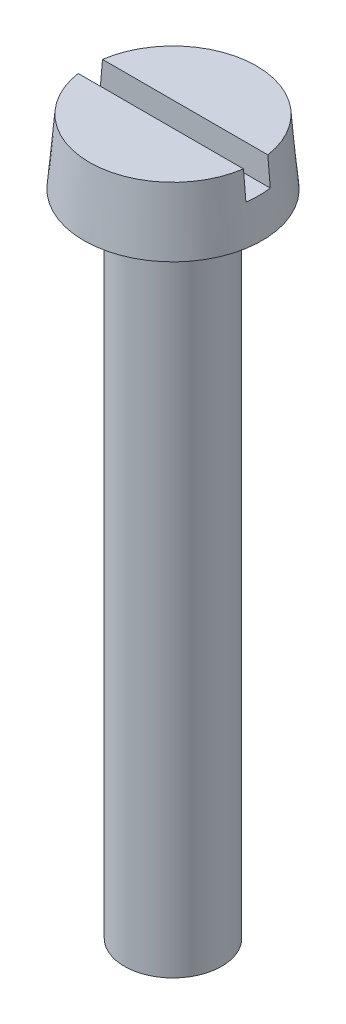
ISO-10303-21;
HEADER;
FILE_DESCRIPTION(('STEP AP214'),'2;1');
FILE_NAME('part.step','',(''),(''),'','','');
FILE_SCHEMA(('AUTOMOTIVE_DESIGN { 1 0 10303 214 1 1 1 1 }'));
ENDSEC;
DATA;
#1=APPLICATION_CONTEXT('core data for automotive mechanical design processes');
#2=APPLICATION_PROTOCOL_DEFINITION('international standard','automotive_design',2000,#1);
#3=PRODUCT_CONTEXT('',#1,'mechanical');
#4=PRODUCT('Part','Part','',(#3));
#5=PRODUCT_RELATED_PRODUCT_CATEGORY('part','',(#4));
#6=PRODUCT_DEFINITION_FORMATION('','',#4);
#7=PRODUCT_DEFINITION_CONTEXT('part definition',#1,'design');
#8=PRODUCT_DEFINITION('design','',#6,#7);
#9=PRODUCT_DEFINITION_SHAPE('','',#8);
#10=(LENGTH_UNIT() NAMED_UNIT(*) SI_UNIT(.MILLI.,.METRE.));
#11=(NAMED_UNIT(*) PLANE_ANGLE_UNIT() SI_UNIT($,.RADIAN.));
#12=(NAMED_UNIT(*) SI_UNIT($,.STERADIAN.) SOLID_ANGLE_UNIT());
#13=UNCERTAINTY_MEASURE_WITH_UNIT(LENGTH_MEASURE(1.E-05),#10,'distance_accuracy_value','');
#14=(GEOMETRIC_REPRESENTATION_CONTEXT(3) GLOBAL_UNCERTAINTY_ASSIGNED_CONTEXT((#13)) GLOBAL_UNIT_ASSIGNED_CONTEXT((#10,
#11,#12)) REPRESENTATION_CONTEXT('',''));
#15=CARTESIAN_POINT('',(0.,0.,0.));
#16=DIRECTION('',(0.,0.,1.));
#17=DIRECTION('',(1.,0.,0.));
#18=AXIS2_PLACEMENT_3D('',#15,#16,#17);
#19=CARTESIAN_POINT('',(3.29999999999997,1.14999999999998,0.375));
#20=DIRECTION('',(0.,-1.,0.));
#21=DIRECTION('',(0.,0.,-1.));
#22=AXIS2_PLACEMENT_3D('',#19,#20,#21);
#23=PLANE('',#22);
#24=CARTESIAN_POINT('',(0.,1.14999999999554,0.));
#25=DIRECTION('',(0.,-1.,0.));
#26=DIRECTION('',(0.,0.,-1.));
#27=AXIS2_PLACEMENT_3D('',#24,#25,#26);
#28=CIRCLE('',#27,2.64938803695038);
#29=CARTESIAN_POINT('',(-2.62271461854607,1.14999999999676,0.375));
#30=VERTEX_POINT('',#29);
#31=CARTESIAN_POINT('',(-2.6227146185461,1.14999999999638,-0.375));
#32=VERTEX_POINT('',#31);
#33=EDGE_CURVE('E70',#30,#32,#28,.T.);
#34=ORIENTED_EDGE('',*,*,#33,.F.);
#35=DIRECTION('',(1.,0.,0.));
#36=VECTOR('',#35,1.);
#37=CARTESIAN_POINT('',(3.29999999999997,1.14999999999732,0.375));
#38=LINE('',#37,#36);
#39=CARTESIAN_POINT('',(2.6227146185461,1.14999999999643,0.375));
#40=VERTEX_POINT('',#39);
#41=EDGE_CURVE('E68',#30,#40,#38,.T.);
#42=ORIENTED_EDGE('',*,*,#41,.T.);
#43=CARTESIAN_POINT('',(0.,1.14999999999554,0.));
#44=DIRECTION('',(0.,-1.,0.));
#45=DIRECTION('',(0.,0.,-1.));
#46=AXIS2_PLACEMENT_3D('',#43,#44,#45);
#47=CIRCLE('',#46,2.64938803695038);
#48=CARTESIAN_POINT('',(2.62271461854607,1.14999999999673,-0.375));
#49=VERTEX_POINT('',#48);
#50=EDGE_CURVE('E19',#49,#40,#47,.T.);
#51=ORIENTED_EDGE('',*,*,#50,.F.);
#52=DIRECTION('',(-1.,0.,0.));
#53=VECTOR('',#52,1.);
#54=CARTESIAN_POINT('',(3.29999999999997,1.14999999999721,-0.375));
#55=LINE('',#54,#53);
#56=EDGE_CURVE('E63',#49,#32,#55,.T.);
#57=ORIENTED_EDGE('',*,*,#56,.T.);
#58=EDGE_LOOP('',(#34,#42,#51,#57));
#59=FACE_BOUND('',#58,.T.);
#60=ADVANCED_FACE('F16',(#59),#23,.F.);
#61=CARTESIAN_POINT('',(3.29999999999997,2.,0.375));
#62=DIRECTION('',(0.,0.,1.));
#63=DIRECTION('',(1.,0.,0.));
#64=AXIS2_PLACEMENT_3D('',#61,#62,#63);
#65=PLANE('',#64);
#66=DIRECTION('',(1.,0.,0.));
#67=VECTOR('',#66,1.);
#68=CARTESIAN_POINT('',(0.,2.,0.375));
#69=LINE('',#68,#67);
#70=CARTESIAN_POINT('',(-2.54757075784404,2.00000000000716,0.375));
#71=VERTEX_POINT('',#70);
#72=CARTESIAN_POINT('',(2.54757075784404,2.00000000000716,0.375));
#73=VERTEX_POINT('',#72);
#74=EDGE_CURVE('E72',#71,#73,#69,.T.);
#75=ORIENTED_EDGE('',*,*,#74,.T.);
#76=CARTESIAN_POINT('',(2.62271461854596,1.14999999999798,0.375));
#77=CARTESIAN_POINT('',(2.61019436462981,1.29166699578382,0.375));
#78=CARTESIAN_POINT('',(2.59767224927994,1.43333382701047,0.375));
#79=CARTESIAN_POINT('',(2.57262429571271,1.71666716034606,0.375));
#80=CARTESIAN_POINT('',(2.56009845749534,1.85833366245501,0.375));
#81=CARTESIAN_POINT('',(2.54757075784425,2.00000000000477,0.375));
#82=B_SPLINE_CURVE_WITH_KNOTS('',3,(#76,#77,#78,#79,#80,#81),.UNSPECIFIED.,.F.,.F.,(4,2,4),(0.,
0.426657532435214,0.853315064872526),.UNSPECIFIED.);
#83=EDGE_CURVE('E79',#40,#73,#82,.T.);
#84=ORIENTED_EDGE('',*,*,#83,.F.);
#85=ORIENTED_EDGE('',*,*,#41,.F.);
#86=CARTESIAN_POINT('',(-2.54757075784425,2.00000000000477,0.375));
#87=CARTESIAN_POINT('',(-2.56009845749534,1.85833366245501,0.375));
#88=CARTESIAN_POINT('',(-2.57262429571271,1.71666716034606,0.375));
#89=CARTESIAN_POINT('',(-2.59767224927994,1.43333382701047,0.375));
#90=CARTESIAN_POINT('',(-2.61019436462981,1.29166699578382,0.375));
#91=CARTESIAN_POINT('',(-2.62271461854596,1.14999999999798,0.375));
#92=B_SPLINE_CURVE_WITH_KNOTS('',3,(#86,#87,#88,#89,#90,#91),.UNSPECIFIED.,.F.,.F.,(4,2,4),(0.,
0.426657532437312,0.853315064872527),.UNSPECIFIED.);
#93=EDGE_CURVE('E110',#71,#30,#92,.T.);
#94=ORIENTED_EDGE('',*,*,#93,.F.);
#95=EDGE_LOOP('',(#75,#84,#85,#94));
#96=FACE_BOUND('',#95,.T.);
#97=ADVANCED_FACE('F119',(#96),#65,.F.);
#98=CARTESIAN_POINT('',(3.29999999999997,1.14999999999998,-0.375));
#99=DIRECTION('',(0.,0.,-1.));
#100=DIRECTION('',(-1.,0.,0.));
#101=AXIS2_PLACEMENT_3D('',#98,#99,#100);
#102=PLANE('',#101);
#103=CARTESIAN_POINT('',(2.54757075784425,2.00000000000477,-0.375));
#104=CARTESIAN_POINT('',(2.56009845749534,1.858333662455,-0.375));
#105=CARTESIAN_POINT('',(2.57262429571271,1.71666716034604,-0.375));
#106=CARTESIAN_POINT('',(2.59767224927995,1.43333382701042,-0.375));
#107=CARTESIAN_POINT('',(2.61019436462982,1.29166699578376,-0.375));
#108=CARTESIAN_POINT('',(2.62271461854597,1.14999999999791,-0.375));
#109=B_SPLINE_CURVE_WITH_KNOTS('',3,(#103,#104,#105,#106,#107,#108),.UNSPECIFIED.,.F.,.F.,(4,2,
4),(0.,0.426657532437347,0.853315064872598),.UNSPECIFIED.);
#110=CARTESIAN_POINT('',(2.54757075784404,2.00000000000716,-0.375));
#111=VERTEX_POINT('',#110);
#112=EDGE_CURVE('E52',#111,#49,#109,.T.);
#113=ORIENTED_EDGE('',*,*,#112,.F.);
#114=DIRECTION('',(1.,0.,0.));
#115=VECTOR('',#114,1.);
#116=CARTESIAN_POINT('',(0.,2.,-0.375));
#117=LINE('',#116,#115);
#118=CARTESIAN_POINT('',(-2.54757075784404,2.00000000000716,-0.375));
#119=VERTEX_POINT('',#118);
#120=EDGE_CURVE('E75',#111,#119,#117,.F.);
#121=ORIENTED_EDGE('',*,*,#120,.T.);
#122=CARTESIAN_POINT('',(-2.62271461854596,1.14999999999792,-0.375));
#123=CARTESIAN_POINT('',(-2.61019436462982,1.29166699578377,-0.375));
#124=CARTESIAN_POINT('',(-2.59767224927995,1.43333382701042,-0.375));
#125=CARTESIAN_POINT('',(-2.57262429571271,1.71666716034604,-0.375));
#126=CARTESIAN_POINT('',(-2.56009845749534,1.858333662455,-0.375));
#127=CARTESIAN_POINT('',(-2.54757075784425,2.00000000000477,-0.375));
#128=B_SPLINE_CURVE_WITH_KNOTS('',3,(#122,#123,#124,#125,#126,#127),.UNSPECIFIED.,.F.,.F.,(4,2,
4),(0.,0.426657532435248,0.853315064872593),.UNSPECIFIED.);
#129=EDGE_CURVE('E34',#32,#119,#128,.T.);
#130=ORIENTED_EDGE('',*,*,#129,.F.);
#131=ORIENTED_EDGE('',*,*,#56,.F.);
#132=EDGE_LOOP('',(#113,#121,#130,#131));
#133=FACE_BOUND('',#132,.T.);
#134=ADVANCED_FACE('F71',(#133),#102,.F.);
#135=CARTESIAN_POINT('',(0.,2.,0.));
#136=DIRECTION('',(0.,-1.,0.));
#137=DIRECTION('',(0.,0.,-1.));
#138=AXIS2_PLACEMENT_3D('',#135,#136,#137);
#139=PLANE('',#138);
#140=CARTESIAN_POINT('',(0.,2.00000000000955,0.));
#141=DIRECTION('',(0.,-1.,0.));
#142=DIRECTION('',(0.,0.,-1.));
#143=AXIS2_PLACEMENT_3D('',#140,#141,#142);
#144=CIRCLE('',#143,2.5750226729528);
#145=EDGE_CURVE('E87',#73,#71,#144,.T.);
#146=ORIENTED_EDGE('',*,*,#145,.F.);
#147=ORIENTED_EDGE('',*,*,#74,.F.);
#148=EDGE_LOOP('',(#146,#147));
#149=FACE_BOUND('',#148,.T.);
#150=ADVANCED_FACE('F129',(#149),#139,.F.);
#151=CARTESIAN_POINT('',(0.,2.,0.));
#152=DIRECTION('',(0.,-1.,0.));
#153=DIRECTION('',(0.,0.,-1.));
#154=AXIS2_PLACEMENT_3D('',#151,#152,#153);
#155=PLANE('',#154);
#156=ORIENTED_EDGE('',*,*,#120,.F.);
#157=CARTESIAN_POINT('',(0.,2.00000000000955,0.));
#158=DIRECTION('',(0.,-1.,0.));
#159=DIRECTION('',(0.,0.,-1.));
#160=AXIS2_PLACEMENT_3D('',#157,#158,#159);
#161=CIRCLE('',#160,2.5750226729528);
#162=EDGE_CURVE('E59',#119,#111,#161,.T.);
#163=ORIENTED_EDGE('',*,*,#162,.F.);
#164=EDGE_LOOP('',(#156,#163));
#165=FACE_BOUND('',#164,.T.);
#166=ADVANCED_FACE('F106',(#165),#155,.F.);
#167=CARTESIAN_POINT('',(0.,5.6843418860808E-11,0.));
#168=DIRECTION('',(0.,-1.,0.));
#169=DIRECTION('',(0.,0.,-1.));
#170=AXIS2_PLACEMENT_3D('',#167,#168,#169);
#171=CONICAL_SURFACE('',#170,2.74999999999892,0.0872664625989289);
#172=ORIENTED_EDGE('',*,*,#83,.T.);
#173=ORIENTED_EDGE('',*,*,#145,.T.);
#174=ORIENTED_EDGE('',*,*,#93,.T.);
#175=ORIENTED_EDGE('',*,*,#33,.T.);
#176=ORIENTED_EDGE('',*,*,#129,.T.);
#177=ORIENTED_EDGE('',*,*,#162,.T.);
#178=ORIENTED_EDGE('',*,*,#112,.T.);
#179=ORIENTED_EDGE('',*,*,#50,.T.);
#180=EDGE_LOOP('',(#172,#173,#174,#175,#176,#177,#178,#179));
#181=FACE_BOUND('',#180,.T.);
#182=CARTESIAN_POINT('',(0.,0.,0.));
#183=DIRECTION('',(0.,-1.,0.));
#184=DIRECTION('',(0.,0.,-1.));
#185=AXIS2_PLACEMENT_3D('',#182,#183,#184);
#186=CIRCLE('',#185,2.75000000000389);
#187=CARTESIAN_POINT('',(0.,0.,-2.75000000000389));
#188=VERTEX_POINT('',#187);
#189=EDGE_CURVE('E83',#188,#188,#186,.T.);
#190=ORIENTED_EDGE('',*,*,#189,.F.);
#191=EDGE_LOOP('',(#190));
#192=FACE_BOUND('',#191,.T.);
#193=ADVANCED_FACE('F55',(#181,#192),#171,.T.);
#194=CARTESIAN_POINT('',(0.,0.,0.));
#195=DIRECTION('',(0.,-1.,0.));
#196=DIRECTION('',(0.,0.,-1.));
#197=AXIS2_PLACEMENT_3D('',#194,#195,#196);
#198=PLANE('',#197);
#199=ORIENTED_EDGE('',*,*,#189,.T.);
#200=EDGE_LOOP('',(#199));
#201=FACE_BOUND('',#200,.T.);
#202=CARTESIAN_POINT('',(0.,0.,0.));
#203=DIRECTION('',(0.,-1.,0.));
#204=DIRECTION('',(0.,0.,-1.));
#205=AXIS2_PLACEMENT_3D('',#202,#203,#204);
#206=CIRCLE('',#205,1.5);
#207=CARTESIAN_POINT('',(0.,0.,-1.5));
#208=VERTEX_POINT('',#207);
#209=EDGE_CURVE('E25',#208,#208,#206,.T.);
#210=ORIENTED_EDGE('',*,*,#209,.F.);
#211=EDGE_LOOP('',(#210));
#212=FACE_BOUND('',#211,.T.);
#213=ADVANCED_FACE('F105',(#201,#212),#198,.T.);
#214=CARTESIAN_POINT('',(0.,-20.,0.));
#215=DIRECTION('',(0.,-1.,0.));
#216=DIRECTION('',(0.,0.,-1.));
#217=AXIS2_PLACEMENT_3D('',#214,#215,#216);
#218=PLANE('',#217);
#219=CARTESIAN_POINT('',(0.,-20.,0.));
#220=DIRECTION('',(0.,-1.,0.));
#221=DIRECTION('',(0.,0.,-1.));
#222=AXIS2_PLACEMENT_3D('',#219,#220,#221);
#223=CIRCLE('',#222,1.5);
#224=CARTESIAN_POINT('',(0.,-20.,-1.5));
#225=VERTEX_POINT('',#224);
#226=EDGE_CURVE('E11',#225,#225,#223,.F.);
#227=ORIENTED_EDGE('',*,*,#226,.F.);
#228=EDGE_LOOP('',(#227));
#229=FACE_BOUND('',#228,.T.);
#230=ADVANCED_FACE('F132',(#229),#218,.T.);
#231=CARTESIAN_POINT('',(0.,3.09999999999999,0.));
#232=DIRECTION('',(0.,-1.,0.));
#233=DIRECTION('',(0.,0.,-1.));
#234=AXIS2_PLACEMENT_3D('',#231,#232,#233);
#235=CYLINDRICAL_SURFACE('',#234,1.5);
#236=ORIENTED_EDGE('',*,*,#226,.T.);
#237=EDGE_LOOP('',(#236));
#238=FACE_BOUND('',#237,.T.);
#239=ORIENTED_EDGE('',*,*,#209,.T.);
#240=EDGE_LOOP('',(#239));
#241=FACE_BOUND('',#240,.T.);
#242=ADVANCED_FACE('F130',(#238,#241),#235,.T.);
#243=CLOSED_SHELL('',(#60,#97,#134,#150,#166,#193,#213,#230,#242));
#244=MANIFOLD_SOLID_BREP('B1',#243);
#245=ADVANCED_BREP_SHAPE_REPRESENTATION('',(#18,#244),#14);
#246=SHAPE_DEFINITION_REPRESENTATION(#9,#245);
ENDSEC;
END-ISO-10303-21;
